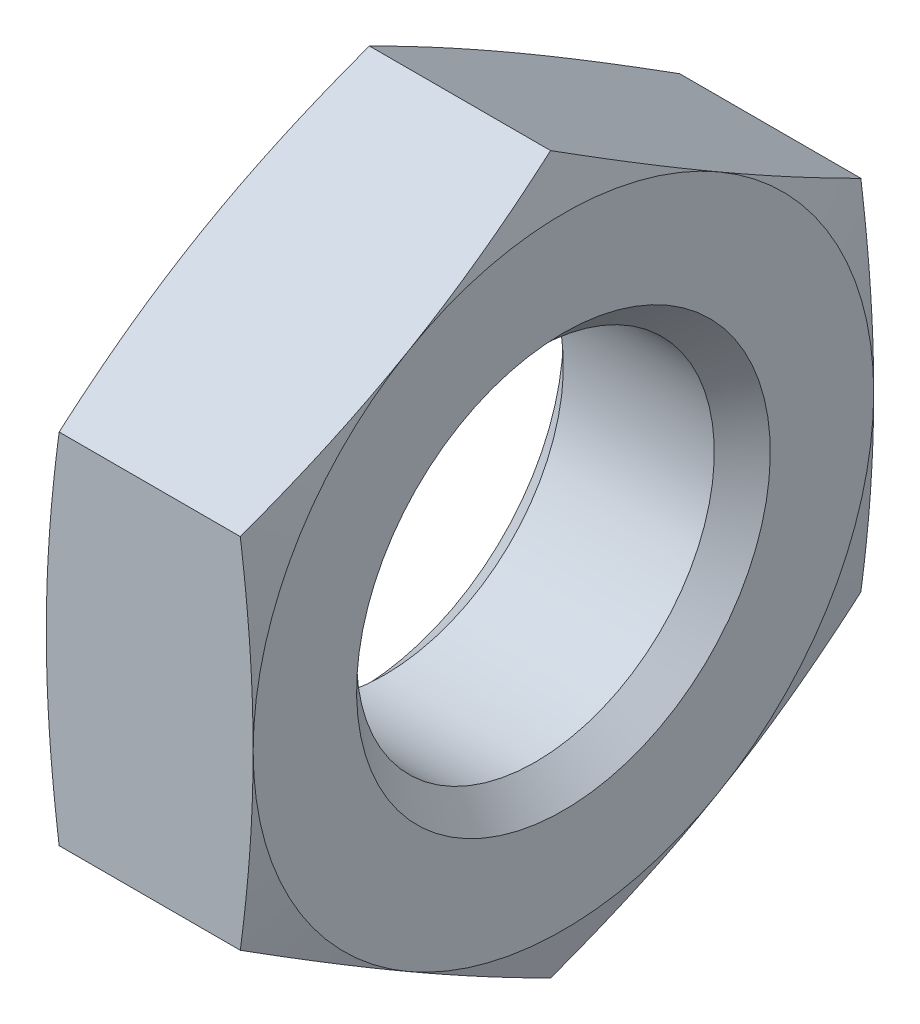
ISO-10303-21;
HEADER;
FILE_DESCRIPTION(('STEP AP214'),'2;1');
FILE_NAME('part.step','',(''),(''),'','','');
FILE_SCHEMA(('AUTOMOTIVE_DESIGN { 1 0 10303 214 1 1 1 1 }'));
ENDSEC;
DATA;
#1=APPLICATION_CONTEXT('core data for automotive mechanical design processes');
#2=APPLICATION_PROTOCOL_DEFINITION('international standard','automotive_design',2000,#1);
#3=PRODUCT_CONTEXT('',#1,'mechanical');
#4=PRODUCT('Part','Part','',(#3));
#5=PRODUCT_RELATED_PRODUCT_CATEGORY('part','',(#4));
#6=PRODUCT_DEFINITION_FORMATION('','',#4);
#7=PRODUCT_DEFINITION_CONTEXT('part definition',#1,'design');
#8=PRODUCT_DEFINITION('design','',#6,#7);
#9=PRODUCT_DEFINITION_SHAPE('','',#8);
#10=(LENGTH_UNIT() NAMED_UNIT(*) SI_UNIT(.MILLI.,.METRE.));
#11=(NAMED_UNIT(*) PLANE_ANGLE_UNIT() SI_UNIT($,.RADIAN.));
#12=(NAMED_UNIT(*) SI_UNIT($,.STERADIAN.) SOLID_ANGLE_UNIT());
#13=UNCERTAINTY_MEASURE_WITH_UNIT(LENGTH_MEASURE(1.E-05),#10,'distance_accuracy_value','');
#14=(GEOMETRIC_REPRESENTATION_CONTEXT(3) GLOBAL_UNCERTAINTY_ASSIGNED_CONTEXT((#13)) GLOBAL_UNIT_ASSIGNED_CONTEXT((#10,
#11,#12)) REPRESENTATION_CONTEXT('',''));
#15=CARTESIAN_POINT('',(0.,0.,0.));
#16=DIRECTION('',(0.,0.,1.));
#17=DIRECTION('',(1.,0.,0.));
#18=AXIS2_PLACEMENT_3D('',#15,#16,#17);
#19=DIRECTION('',(-0.707106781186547,0.707106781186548,0.));
#20=VECTOR('',#19,1.);
#21=CARTESIAN_POINT('',(0.54125,7.45875,0.));
#22=LINE('',#21,#20);
#23=CARTESIAN_POINT('',(8.,0.,0.));
#24=DIRECTION('',(-1.,0.,0.));
#25=AXIS1_PLACEMENT('',#23,#24);
#26=SURFACE_OF_REVOLUTION('',#22,#25);
#27=CARTESIAN_POINT('',(1.0825,0.,0.));
#28=DIRECTION('',(-1.,0.,0.));
#29=DIRECTION('',(0.,1.,0.));
#30=AXIS2_PLACEMENT_3D('',#27,#28,#29);
#31=CIRCLE('',#30,6.9175);
#32=CARTESIAN_POINT('',(1.0825,6.9175,0.));
#33=VERTEX_POINT('',#32);
#34=EDGE_CURVE('E400',#33,#33,#31,.T.);
#35=ORIENTED_EDGE('',*,*,#34,.F.);
#36=EDGE_LOOP('',(#35));
#37=FACE_BOUND('',#36,.T.);
#38=CARTESIAN_POINT('',(0.,0.,0.));
#39=DIRECTION('',(-1.,0.,0.));
#40=DIRECTION('',(0.,1.,0.));
#41=AXIS2_PLACEMENT_3D('',#38,#39,#40);
#42=CIRCLE('',#41,8.);
#43=CARTESIAN_POINT('',(0.,8.,0.));
#44=VERTEX_POINT('',#43);
#45=EDGE_CURVE('E11',#44,#44,#42,.T.);
#46=ORIENTED_EDGE('',*,*,#45,.T.);
#47=EDGE_LOOP('',(#46));
#48=FACE_BOUND('',#47,.T.);
#49=ADVANCED_FACE('F17',(#37,#48),#26,.F.);
#50=CARTESIAN_POINT('',(0.,10.,0.));
#51=DIRECTION('',(-1.,0.,0.));
#52=DIRECTION('',(0.,-1.,0.));
#53=AXIS2_PLACEMENT_3D('',#50,#51,#52);
#54=PLANE('',#53);
#55=CARTESIAN_POINT('',(0.,0.,0.));
#56=DIRECTION('',(-1.,0.,0.));
#57=DIRECTION('',(0.,1.,0.));
#58=AXIS2_PLACEMENT_3D('',#55,#56,#57);
#59=CIRCLE('',#58,12.);
#60=CARTESIAN_POINT('',(0.,10.3923048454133,6.));
#61=VERTEX_POINT('',#60);
#62=CARTESIAN_POINT('',(0.,10.3923048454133,-6.));
#63=VERTEX_POINT('',#62);
#64=EDGE_CURVE('E27',#61,#63,#59,.T.);
#65=ORIENTED_EDGE('',*,*,#64,.T.);
#66=CARTESIAN_POINT('',(0.,0.,0.));
#67=DIRECTION('',(-1.,0.,0.));
#68=DIRECTION('',(0.,1.,0.));
#69=AXIS2_PLACEMENT_3D('',#66,#67,#68);
#70=CIRCLE('',#69,12.);
#71=CARTESIAN_POINT('',(0.,0.,-12.));
#72=VERTEX_POINT('',#71);
#73=EDGE_CURVE('E312',#63,#72,#70,.T.);
#74=ORIENTED_EDGE('',*,*,#73,.T.);
#75=CARTESIAN_POINT('',(0.,0.,0.));
#76=DIRECTION('',(-1.,0.,0.));
#77=DIRECTION('',(0.,1.,0.));
#78=AXIS2_PLACEMENT_3D('',#75,#76,#77);
#79=CIRCLE('',#78,12.);
#80=CARTESIAN_POINT('',(0.,-10.3923048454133,-6.));
#81=VERTEX_POINT('',#80);
#82=EDGE_CURVE('E306',#72,#81,#79,.T.);
#83=ORIENTED_EDGE('',*,*,#82,.T.);
#84=CARTESIAN_POINT('',(0.,0.,0.));
#85=DIRECTION('',(-1.,0.,0.));
#86=DIRECTION('',(0.,1.,0.));
#87=AXIS2_PLACEMENT_3D('',#84,#85,#86);
#88=CIRCLE('',#87,12.);
#89=CARTESIAN_POINT('',(0.,-10.3923048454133,6.));
#90=VERTEX_POINT('',#89);
#91=EDGE_CURVE('E313',#81,#90,#88,.T.);
#92=ORIENTED_EDGE('',*,*,#91,.T.);
#93=CARTESIAN_POINT('',(0.,0.,0.));
#94=DIRECTION('',(-1.,0.,0.));
#95=DIRECTION('',(0.,1.,0.));
#96=AXIS2_PLACEMENT_3D('',#93,#94,#95);
#97=CIRCLE('',#96,12.);
#98=CARTESIAN_POINT('',(0.,0.,12.));
#99=VERTEX_POINT('',#98);
#100=EDGE_CURVE('E367',#90,#99,#97,.T.);
#101=ORIENTED_EDGE('',*,*,#100,.T.);
#102=CARTESIAN_POINT('',(0.,0.,0.));
#103=DIRECTION('',(-1.,0.,0.));
#104=DIRECTION('',(0.,1.,0.));
#105=AXIS2_PLACEMENT_3D('',#102,#103,#104);
#106=CIRCLE('',#105,12.);
#107=EDGE_CURVE('E340',#99,#61,#106,.T.);
#108=ORIENTED_EDGE('',*,*,#107,.T.);
#109=EDGE_LOOP('',(#65,#74,#83,#92,#101,#108));
#110=FACE_BOUND('',#109,.T.);
#111=ORIENTED_EDGE('',*,*,#45,.F.);
#112=EDGE_LOOP('',(#111));
#113=FACE_BOUND('',#112,.T.);
#114=ADVANCED_FACE('F153',(#110,#113),#54,.T.);
#115=CARTESIAN_POINT('',(8.,10.,0.));
#116=DIRECTION('',(1.,0.,0.));
#117=DIRECTION('',(0.,0.,-1.));
#118=AXIS2_PLACEMENT_3D('',#115,#116,#117);
#119=PLANE('',#118);
#120=CARTESIAN_POINT('',(8.,0.,0.));
#121=DIRECTION('',(-1.,0.,0.));
#122=DIRECTION('',(0.,1.,0.));
#123=AXIS2_PLACEMENT_3D('',#120,#121,#122);
#124=CIRCLE('',#123,8.);
#125=CARTESIAN_POINT('',(8.,8.,0.));
#126=VERTEX_POINT('',#125);
#127=EDGE_CURVE('E406',#126,#126,#124,.T.);
#128=ORIENTED_EDGE('',*,*,#127,.T.);
#129=EDGE_LOOP('',(#128));
#130=FACE_BOUND('',#129,.T.);
#131=CARTESIAN_POINT('',(8.,0.,0.));
#132=DIRECTION('',(-1.,0.,0.));
#133=DIRECTION('',(0.,1.,0.));
#134=AXIS2_PLACEMENT_3D('',#131,#132,#133);
#135=CIRCLE('',#134,12.);
#136=CARTESIAN_POINT('',(8.,10.3923048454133,6.));
#137=VERTEX_POINT('',#136);
#138=CARTESIAN_POINT('',(8.,10.3923048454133,-6.));
#139=VERTEX_POINT('',#138);
#140=EDGE_CURVE('E125',#137,#139,#135,.T.);
#141=ORIENTED_EDGE('',*,*,#140,.F.);
#142=CARTESIAN_POINT('',(8.,0.,0.));
#143=DIRECTION('',(-1.,0.,0.));
#144=DIRECTION('',(0.,1.,0.));
#145=AXIS2_PLACEMENT_3D('',#142,#143,#144);
#146=CIRCLE('',#145,12.);
#147=CARTESIAN_POINT('',(8.,0.,12.));
#148=VERTEX_POINT('',#147);
#149=EDGE_CURVE('E126',#148,#137,#146,.T.);
#150=ORIENTED_EDGE('',*,*,#149,.F.);
#151=CARTESIAN_POINT('',(8.,0.,0.));
#152=DIRECTION('',(-1.,0.,0.));
#153=DIRECTION('',(0.,1.,0.));
#154=AXIS2_PLACEMENT_3D('',#151,#152,#153);
#155=CIRCLE('',#154,12.);
#156=CARTESIAN_POINT('',(8.,-10.3923048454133,6.));
#157=VERTEX_POINT('',#156);
#158=EDGE_CURVE('E305',#157,#148,#155,.T.);
#159=ORIENTED_EDGE('',*,*,#158,.F.);
#160=CARTESIAN_POINT('',(8.,0.,0.));
#161=DIRECTION('',(-1.,0.,0.));
#162=DIRECTION('',(0.,1.,0.));
#163=AXIS2_PLACEMENT_3D('',#160,#161,#162);
#164=CIRCLE('',#163,12.);
#165=CARTESIAN_POINT('',(8.,-10.3923048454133,-6.));
#166=VERTEX_POINT('',#165);
#167=EDGE_CURVE('E353',#166,#157,#164,.T.);
#168=ORIENTED_EDGE('',*,*,#167,.F.);
#169=CARTESIAN_POINT('',(8.,0.,0.));
#170=DIRECTION('',(-1.,0.,0.));
#171=DIRECTION('',(0.,1.,0.));
#172=AXIS2_PLACEMENT_3D('',#169,#170,#171);
#173=CIRCLE('',#172,12.);
#174=CARTESIAN_POINT('',(8.,0.,-12.));
#175=VERTEX_POINT('',#174);
#176=EDGE_CURVE('E285',#175,#166,#173,.T.);
#177=ORIENTED_EDGE('',*,*,#176,.F.);
#178=CARTESIAN_POINT('',(8.,0.,0.));
#179=DIRECTION('',(-1.,0.,0.));
#180=DIRECTION('',(0.,1.,0.));
#181=AXIS2_PLACEMENT_3D('',#178,#179,#180);
#182=CIRCLE('',#181,12.);
#183=EDGE_CURVE('E293',#139,#175,#182,.T.);
#184=ORIENTED_EDGE('',*,*,#183,.F.);
#185=EDGE_LOOP('',(#141,#150,#159,#168,#177,#184));
#186=FACE_BOUND('',#185,.T.);
#187=ADVANCED_FACE('F157',(#130,#186),#119,.T.);
#188=DIRECTION('',(0.707106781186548,0.707106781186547,0.));
#189=VECTOR('',#188,1.);
#190=CARTESIAN_POINT('',(7.45875,7.45875,0.));
#191=LINE('',#190,#189);
#192=CARTESIAN_POINT('',(0.,0.,0.));
#193=DIRECTION('',(1.,0.,0.));
#194=AXIS1_PLACEMENT('',#192,#193);
#195=SURFACE_OF_REVOLUTION('',#191,#194);
#196=ORIENTED_EDGE('',*,*,#127,.F.);
#197=EDGE_LOOP('',(#196));
#198=FACE_BOUND('',#197,.T.);
#199=CARTESIAN_POINT('',(6.9175,0.,0.));
#200=DIRECTION('',(-1.,0.,0.));
#201=DIRECTION('',(0.,1.,0.));
#202=AXIS2_PLACEMENT_3D('',#199,#200,#201);
#203=CIRCLE('',#202,6.9175);
#204=CARTESIAN_POINT('',(6.9175,6.9175,0.));
#205=VERTEX_POINT('',#204);
#206=EDGE_CURVE('E323',#205,#205,#203,.T.);
#207=ORIENTED_EDGE('',*,*,#206,.T.);
#208=EDGE_LOOP('',(#207));
#209=FACE_BOUND('',#208,.T.);
#210=ADVANCED_FACE('F161',(#198,#209),#195,.F.);
#211=CARTESIAN_POINT('',(4.,0.,0.));
#212=DIRECTION('',(1.,0.,0.));
#213=DIRECTION('',(0.,1.,0.));
#214=AXIS2_PLACEMENT_3D('',#211,#212,#213);
#215=CIRCLE('',#214,6.9175);
#216=DIRECTION('',(-1.,0.,0.));
#217=VECTOR('',#216,1.);
#218=SURFACE_OF_LINEAR_EXTRUSION('',#215,#217);
#219=ORIENTED_EDGE('',*,*,#206,.F.);
#220=EDGE_LOOP('',(#219));
#221=FACE_BOUND('',#220,.T.);
#222=ORIENTED_EDGE('',*,*,#34,.T.);
#223=EDGE_LOOP('',(#222));
#224=FACE_BOUND('',#223,.T.);
#225=ADVANCED_FACE('F165',(#221,#224),#218,.T.);
#226=DIRECTION('',(0.258819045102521,-0.965925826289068,0.));
#227=VECTOR('',#226,1.);
#228=CARTESIAN_POINT('',(6.,19.4641016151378,0.));
#229=LINE('',#228,#227);
#230=CARTESIAN_POINT('',(11.2153903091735,0.,0.));
#231=DIRECTION('',(-1.,0.,0.));
#232=AXIS1_PLACEMENT('',#230,#231);
#233=SURFACE_OF_REVOLUTION('',#229,#232);
#234=CARTESIAN_POINT('',(8.,10.3923048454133,6.));
#235=CARTESIAN_POINT('',(8.,8.78460969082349,8.78460969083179));
#236=CARTESIAN_POINT('',(7.50257738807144,6.92820323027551,12.));
#237=(BOUNDED_CURVE() B_SPLINE_CURVE(2,(#234,#235,#236),.UNSPECIFIED.,.F.,
.F.) B_SPLINE_CURVE_WITH_KNOTS((3,3),(24.476174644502,33.6439861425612),
.UNSPECIFIED.) CURVE() GEOMETRIC_REPRESENTATION_ITEM() RATIONAL_B_SPLINE_CURVE((1.,
1.10247265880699,1.12818086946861)) REPRESENTATION_ITEM(''));
#238=CARTESIAN_POINT('',(7.50257738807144,6.92820323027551,12.));
#239=VERTEX_POINT('',#238);
#240=EDGE_CURVE('E131',#137,#239,#237,.T.);
#241=ORIENTED_EDGE('',*,*,#240,.T.);
#242=CARTESIAN_POINT('',(7.50257738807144,6.92820323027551,12.));
#243=CARTESIAN_POINT('',(8.,3.21539030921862,12.));
#244=CARTESIAN_POINT('',(8.,0.,12.));
#245=(BOUNDED_CURVE() B_SPLINE_CURVE(2,(#242,#243,#244),.UNSPECIFIED.,.F.,
.F.) B_SPLINE_CURVE_WITH_KNOTS((3,3),(15.3083631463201,24.476174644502),
.UNSPECIFIED.) CURVE() GEOMETRIC_REPRESENTATION_ITEM() RATIONAL_B_SPLINE_CURVE((1.12818086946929,
1.10247265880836,1.)) REPRESENTATION_ITEM(''));
#246=EDGE_CURVE('E392',#239,#148,#245,.T.);
#247=ORIENTED_EDGE('',*,*,#246,.T.);
#248=ORIENTED_EDGE('',*,*,#149,.T.);
#249=EDGE_LOOP('',(#241,#247,#248));
#250=FACE_BOUND('',#249,.T.);
#251=ADVANCED_FACE('F169',(#250),#233,.F.);
#252=DIRECTION('',(0.258819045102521,-0.965925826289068,0.));
#253=VECTOR('',#252,1.);
#254=CARTESIAN_POINT('',(6.,19.4641016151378,0.));
#255=LINE('',#254,#253);
#256=CARTESIAN_POINT('',(11.2153903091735,0.,0.));
#257=DIRECTION('',(-1.,0.,0.));
#258=AXIS1_PLACEMENT('',#256,#257);
#259=SURFACE_OF_REVOLUTION('',#255,#258);
#260=CARTESIAN_POINT('',(8.,10.3923048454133,-6.));
#261=CARTESIAN_POINT('',(8.,12.000000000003,-3.21539030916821));
#262=CARTESIAN_POINT('',(7.50257738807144,13.856406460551,0.));
#263=(BOUNDED_CURVE() B_SPLINE_CURVE(2,(#260,#261,#262),.UNSPECIFIED.,.F.,
.F.) B_SPLINE_CURVE_WITH_KNOTS((3,3),(24.476174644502,33.6439861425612),
.UNSPECIFIED.) CURVE() GEOMETRIC_REPRESENTATION_ITEM() RATIONAL_B_SPLINE_CURVE((1.,
1.10247265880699,1.12818086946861)) REPRESENTATION_ITEM(''));
#264=CARTESIAN_POINT('',(7.50257738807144,13.856406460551,0.));
#265=VERTEX_POINT('',#264);
#266=EDGE_CURVE('E115',#139,#265,#263,.T.);
#267=ORIENTED_EDGE('',*,*,#266,.T.);
#268=CARTESIAN_POINT('',(7.50257738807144,13.856406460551,0.));
#269=CARTESIAN_POINT('',(8.,12.0000000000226,3.21539030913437));
#270=CARTESIAN_POINT('',(8.,10.3923048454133,6.));
#271=(BOUNDED_CURVE() B_SPLINE_CURVE(2,(#268,#269,#270),.UNSPECIFIED.,.F.,
.F.) B_SPLINE_CURVE_WITH_KNOTS((3,3),(15.3083631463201,24.476174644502),
.UNSPECIFIED.) CURVE() GEOMETRIC_REPRESENTATION_ITEM() RATIONAL_B_SPLINE_CURVE((1.1281808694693,
1.10247265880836,1.)) REPRESENTATION_ITEM(''));
#272=EDGE_CURVE('E124',#265,#137,#271,.T.);
#273=ORIENTED_EDGE('',*,*,#272,.T.);
#274=ORIENTED_EDGE('',*,*,#140,.T.);
#275=EDGE_LOOP('',(#267,#273,#274));
#276=FACE_BOUND('',#275,.T.);
#277=ADVANCED_FACE('F123',(#276),#259,.F.);
#278=DIRECTION('',(0.258819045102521,-0.965925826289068,0.));
#279=VECTOR('',#278,1.);
#280=CARTESIAN_POINT('',(6.,19.4641016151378,0.));
#281=LINE('',#280,#279);
#282=CARTESIAN_POINT('',(11.2153903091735,0.,0.));
#283=DIRECTION('',(-1.,0.,0.));
#284=AXIS1_PLACEMENT('',#282,#283);
#285=SURFACE_OF_REVOLUTION('',#281,#284);
#286=CARTESIAN_POINT('',(8.,0.,-12.));
#287=CARTESIAN_POINT('',(8.,3.21539030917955,-12.));
#288=CARTESIAN_POINT('',(7.50257738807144,6.92820323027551,-12.));
#289=(BOUNDED_CURVE() B_SPLINE_CURVE(2,(#286,#287,#288),.UNSPECIFIED.,.F.,
.F.) B_SPLINE_CURVE_WITH_KNOTS((3,3),(24.476174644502,33.6439861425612),
.UNSPECIFIED.) CURVE() GEOMETRIC_REPRESENTATION_ITEM() RATIONAL_B_SPLINE_CURVE((1.,
1.10247265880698,1.1281808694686)) REPRESENTATION_ITEM(''));
#290=CARTESIAN_POINT('',(7.50257738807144,6.92820323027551,-12.));
#291=VERTEX_POINT('',#290);
#292=EDGE_CURVE('E133',#175,#291,#289,.T.);
#293=ORIENTED_EDGE('',*,*,#292,.T.);
#294=CARTESIAN_POINT('',(7.50257738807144,6.92820323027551,-12.));
#295=CARTESIAN_POINT('',(8.,8.78460969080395,-8.78460969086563));
#296=CARTESIAN_POINT('',(8.,10.3923048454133,-6.));
#297=(BOUNDED_CURVE() B_SPLINE_CURVE(2,(#294,#295,#296),.UNSPECIFIED.,.F.,
.F.) B_SPLINE_CURVE_WITH_KNOTS((3,3),(15.3083631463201,24.476174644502),
.UNSPECIFIED.) CURVE() GEOMETRIC_REPRESENTATION_ITEM() RATIONAL_B_SPLINE_CURVE((1.1281808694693,
1.10247265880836,1.)) REPRESENTATION_ITEM(''));
#298=EDGE_CURVE('E318',#291,#139,#297,.T.);
#299=ORIENTED_EDGE('',*,*,#298,.T.);
#300=ORIENTED_EDGE('',*,*,#183,.T.);
#301=EDGE_LOOP('',(#293,#299,#300));
#302=FACE_BOUND('',#301,.T.);
#303=ADVANCED_FACE('F182',(#302),#285,.F.);
#304=DIRECTION('',(0.258819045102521,-0.965925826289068,0.));
#305=VECTOR('',#304,1.);
#306=CARTESIAN_POINT('',(6.,19.4641016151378,0.));
#307=LINE('',#306,#305);
#308=CARTESIAN_POINT('',(11.2153903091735,0.,0.));
#309=DIRECTION('',(-1.,0.,0.));
#310=AXIS1_PLACEMENT('',#308,#309);
#311=SURFACE_OF_REVOLUTION('',#307,#310);
#312=CARTESIAN_POINT('',(7.50257738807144,-6.92820323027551,-12.));
#313=CARTESIAN_POINT('',(8.,-3.21539030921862,-12.));
#314=CARTESIAN_POINT('',(8.,0.,-12.));
#315=(BOUNDED_CURVE() B_SPLINE_CURVE(2,(#312,#313,#314),.UNSPECIFIED.,.F.,
.F.) B_SPLINE_CURVE_WITH_KNOTS((3,3),(15.3083631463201,24.476174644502),
.UNSPECIFIED.) CURVE() GEOMETRIC_REPRESENTATION_ITEM() RATIONAL_B_SPLINE_CURVE((1.12818086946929,
1.10247265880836,1.)) REPRESENTATION_ITEM(''));
#316=CARTESIAN_POINT('',(7.50257738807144,-6.92820323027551,-12.));
#317=VERTEX_POINT('',#316);
#318=EDGE_CURVE('E286',#317,#175,#315,.T.);
#319=ORIENTED_EDGE('',*,*,#318,.T.);
#320=ORIENTED_EDGE('',*,*,#176,.T.);
#321=CARTESIAN_POINT('',(8.,-10.3923048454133,-6.));
#322=CARTESIAN_POINT('',(8.,-8.78460969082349,-8.78460969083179));
#323=CARTESIAN_POINT('',(7.50257738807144,-6.92820323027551,-12.));
#324=(BOUNDED_CURVE() B_SPLINE_CURVE(2,(#321,#322,#323),.UNSPECIFIED.,.F.,
.F.) B_SPLINE_CURVE_WITH_KNOTS((3,3),(24.476174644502,33.6439861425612),
.UNSPECIFIED.) CURVE() GEOMETRIC_REPRESENTATION_ITEM() RATIONAL_B_SPLINE_CURVE((1.,
1.10247265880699,1.12818086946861)) REPRESENTATION_ITEM(''));
#325=EDGE_CURVE('E281',#166,#317,#324,.T.);
#326=ORIENTED_EDGE('',*,*,#325,.T.);
#327=EDGE_LOOP('',(#319,#320,#326));
#328=FACE_BOUND('',#327,.T.);
#329=ADVANCED_FACE('F185',(#328),#311,.F.);
#330=DIRECTION('',(0.258819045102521,-0.965925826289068,0.));
#331=VECTOR('',#330,1.);
#332=CARTESIAN_POINT('',(6.,19.4641016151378,0.));
#333=LINE('',#332,#331);
#334=CARTESIAN_POINT('',(11.2153903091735,0.,0.));
#335=DIRECTION('',(-1.,0.,0.));
#336=AXIS1_PLACEMENT('',#334,#335);
#337=SURFACE_OF_REVOLUTION('',#333,#336);
#338=CARTESIAN_POINT('',(7.50257738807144,-13.856406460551,0.));
#339=CARTESIAN_POINT('',(8.,-12.0000000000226,-3.21539030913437));
#340=CARTESIAN_POINT('',(8.,-10.3923048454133,-6.));
#341=(BOUNDED_CURVE() B_SPLINE_CURVE(2,(#338,#339,#340),.UNSPECIFIED.,.F.,
.F.) B_SPLINE_CURVE_WITH_KNOTS((3,3),(15.30836314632,24.476174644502),
.UNSPECIFIED.) CURVE() GEOMETRIC_REPRESENTATION_ITEM() RATIONAL_B_SPLINE_CURVE((1.1281808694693,
1.10247265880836,1.)) REPRESENTATION_ITEM(''));
#342=CARTESIAN_POINT('',(7.50257738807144,-13.856406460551,0.));
#343=VERTEX_POINT('',#342);
#344=EDGE_CURVE('E269',#343,#166,#341,.T.);
#345=ORIENTED_EDGE('',*,*,#344,.T.);
#346=ORIENTED_EDGE('',*,*,#167,.T.);
#347=CARTESIAN_POINT('',(8.,-10.3923048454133,6.));
#348=CARTESIAN_POINT('',(8.,-12.000000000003,3.2153903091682));
#349=CARTESIAN_POINT('',(7.50257738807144,-13.856406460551,0.));
#350=(BOUNDED_CURVE() B_SPLINE_CURVE(2,(#347,#348,#349),.UNSPECIFIED.,.F.,
.F.) B_SPLINE_CURVE_WITH_KNOTS((3,3),(24.476174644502,33.6439861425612),
.UNSPECIFIED.) CURVE() GEOMETRIC_REPRESENTATION_ITEM() RATIONAL_B_SPLINE_CURVE((1.,
1.10247265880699,1.12818086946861)) REPRESENTATION_ITEM(''));
#351=EDGE_CURVE('E304',#157,#343,#350,.T.);
#352=ORIENTED_EDGE('',*,*,#351,.T.);
#353=EDGE_LOOP('',(#345,#346,#352));
#354=FACE_BOUND('',#353,.T.);
#355=ADVANCED_FACE('F189',(#354),#337,.F.);
#356=DIRECTION('',(0.258819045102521,-0.965925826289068,0.));
#357=VECTOR('',#356,1.);
#358=CARTESIAN_POINT('',(6.,19.4641016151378,0.));
#359=LINE('',#358,#357);
#360=CARTESIAN_POINT('',(11.2153903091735,0.,0.));
#361=DIRECTION('',(-1.,0.,0.));
#362=AXIS1_PLACEMENT('',#360,#361);
#363=SURFACE_OF_REVOLUTION('',#359,#362);
#364=CARTESIAN_POINT('',(7.50257738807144,-6.92820323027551,12.));
#365=CARTESIAN_POINT('',(8.,-8.78460969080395,8.78460969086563));
#366=CARTESIAN_POINT('',(8.,-10.3923048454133,6.));
#367=(BOUNDED_CURVE() B_SPLINE_CURVE(2,(#364,#365,#366),.UNSPECIFIED.,.F.,
.F.) B_SPLINE_CURVE_WITH_KNOTS((3,3),(15.30836314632,24.476174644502),
.UNSPECIFIED.) CURVE() GEOMETRIC_REPRESENTATION_ITEM() RATIONAL_B_SPLINE_CURVE((1.1281808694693,
1.10247265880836,1.)) REPRESENTATION_ITEM(''));
#368=CARTESIAN_POINT('',(7.50257738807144,-6.92820323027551,12.));
#369=VERTEX_POINT('',#368);
#370=EDGE_CURVE('E299',#369,#157,#367,.T.);
#371=ORIENTED_EDGE('',*,*,#370,.T.);
#372=ORIENTED_EDGE('',*,*,#158,.T.);
#373=CARTESIAN_POINT('',(8.,0.,12.));
#374=CARTESIAN_POINT('',(8.,-3.21539030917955,12.));
#375=CARTESIAN_POINT('',(7.50257738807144,-6.92820323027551,12.));
#376=(BOUNDED_CURVE() B_SPLINE_CURVE(2,(#373,#374,#375),.UNSPECIFIED.,.F.,
.F.) B_SPLINE_CURVE_WITH_KNOTS((3,3),(24.476174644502,33.6439861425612),
.UNSPECIFIED.) CURVE() GEOMETRIC_REPRESENTATION_ITEM() RATIONAL_B_SPLINE_CURVE((1.,
1.10247265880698,1.12818086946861)) REPRESENTATION_ITEM(''));
#377=EDGE_CURVE('E361',#148,#369,#376,.T.);
#378=ORIENTED_EDGE('',*,*,#377,.T.);
#379=EDGE_LOOP('',(#371,#372,#378));
#380=FACE_BOUND('',#379,.T.);
#381=ADVANCED_FACE('F200',(#380),#363,.F.);
#382=DIRECTION('',(-0.258819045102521,-0.965925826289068,0.));
#383=VECTOR('',#382,1.);
#384=CARTESIAN_POINT('',(2.,19.4641016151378,0.));
#385=LINE('',#384,#383);
#386=CARTESIAN_POINT('',(-3.21539030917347,0.,0.));
#387=DIRECTION('',(1.,0.,0.));
#388=AXIS1_PLACEMENT('',#386,#387);
#389=SURFACE_OF_REVOLUTION('',#385,#388);
#390=CARTESIAN_POINT('',(0.,10.3923048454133,6.));
#391=CARTESIAN_POINT('',(0.,12.000000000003,3.21539030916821));
#392=CARTESIAN_POINT('',(0.497422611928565,13.856406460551,0.));
#393=(BOUNDED_CURVE() B_SPLINE_CURVE(2,(#390,#391,#392),.UNSPECIFIED.,.F.,
.F.) B_SPLINE_CURVE_WITH_KNOTS((3,3),(24.476174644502,33.6439861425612),
.UNSPECIFIED.) CURVE() GEOMETRIC_REPRESENTATION_ITEM() RATIONAL_B_SPLINE_CURVE((1.,
1.10247265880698,1.12818086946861)) REPRESENTATION_ITEM(''));
#394=CARTESIAN_POINT('',(0.497422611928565,13.856406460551,0.));
#395=VERTEX_POINT('',#394);
#396=EDGE_CURVE('E354',#61,#395,#393,.T.);
#397=ORIENTED_EDGE('',*,*,#396,.T.);
#398=CARTESIAN_POINT('',(0.497422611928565,13.856406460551,0.));
#399=CARTESIAN_POINT('',(0.,12.0000000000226,-3.21539030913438));
#400=CARTESIAN_POINT('',(0.,10.3923048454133,-6.));
#401=(BOUNDED_CURVE() B_SPLINE_CURVE(2,(#398,#399,#400),.UNSPECIFIED.,.F.,
.F.) B_SPLINE_CURVE_WITH_KNOTS((3,3),(15.3083631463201,24.476174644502),
.UNSPECIFIED.) CURVE() GEOMETRIC_REPRESENTATION_ITEM() RATIONAL_B_SPLINE_CURVE((1.1281808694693,
1.10247265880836,1.)) REPRESENTATION_ITEM(''));
#402=EDGE_CURVE('E36',#395,#63,#401,.T.);
#403=ORIENTED_EDGE('',*,*,#402,.T.);
#404=ORIENTED_EDGE('',*,*,#64,.F.);
#405=EDGE_LOOP('',(#397,#403,#404));
#406=FACE_BOUND('',#405,.T.);
#407=ADVANCED_FACE('F203',(#406),#389,.F.);
#408=DIRECTION('',(-0.258819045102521,-0.965925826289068,0.));
#409=VECTOR('',#408,1.);
#410=CARTESIAN_POINT('',(2.,19.4641016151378,0.));
#411=LINE('',#410,#409);
#412=CARTESIAN_POINT('',(-3.21539030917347,0.,0.));
#413=DIRECTION('',(1.,0.,0.));
#414=AXIS1_PLACEMENT('',#412,#413);
#415=SURFACE_OF_REVOLUTION('',#411,#414);
#416=CARTESIAN_POINT('',(0.,0.,12.));
#417=CARTESIAN_POINT('',(0.,3.21539030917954,12.));
#418=CARTESIAN_POINT('',(0.497422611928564,6.92820323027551,12.));
#419=(BOUNDED_CURVE() B_SPLINE_CURVE(2,(#416,#417,#418),.UNSPECIFIED.,.F.,
.F.) B_SPLINE_CURVE_WITH_KNOTS((3,3),(24.476174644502,33.6439861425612),
.UNSPECIFIED.) CURVE() GEOMETRIC_REPRESENTATION_ITEM() RATIONAL_B_SPLINE_CURVE((1.,
1.10247265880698,1.12818086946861)) REPRESENTATION_ITEM(''));
#420=CARTESIAN_POINT('',(0.497422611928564,6.92820323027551,12.));
#421=VERTEX_POINT('',#420);
#422=EDGE_CURVE('E388',#99,#421,#419,.T.);
#423=ORIENTED_EDGE('',*,*,#422,.T.);
#424=CARTESIAN_POINT('',(0.497422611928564,6.92820323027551,12.));
#425=CARTESIAN_POINT('',(0.,8.78460969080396,8.78460969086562));
#426=CARTESIAN_POINT('',(0.,10.3923048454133,6.));
#427=(BOUNDED_CURVE() B_SPLINE_CURVE(2,(#424,#425,#426),.UNSPECIFIED.,.F.,
.F.) B_SPLINE_CURVE_WITH_KNOTS((3,3),(15.3083631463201,24.476174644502),
.UNSPECIFIED.) CURVE() GEOMETRIC_REPRESENTATION_ITEM() RATIONAL_B_SPLINE_CURVE((1.1281808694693,
1.10247265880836,1.)) REPRESENTATION_ITEM(''));
#428=EDGE_CURVE('E82',#421,#61,#427,.T.);
#429=ORIENTED_EDGE('',*,*,#428,.T.);
#430=ORIENTED_EDGE('',*,*,#107,.F.);
#431=EDGE_LOOP('',(#423,#429,#430));
#432=FACE_BOUND('',#431,.T.);
#433=ADVANCED_FACE('F207',(#432),#415,.F.);
#434=DIRECTION('',(-0.258819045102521,-0.965925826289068,0.));
#435=VECTOR('',#434,1.);
#436=CARTESIAN_POINT('',(2.,19.4641016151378,0.));
#437=LINE('',#436,#435);
#438=CARTESIAN_POINT('',(-3.21539030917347,0.,0.));
#439=DIRECTION('',(1.,0.,0.));
#440=AXIS1_PLACEMENT('',#438,#439);
#441=SURFACE_OF_REVOLUTION('',#437,#440);
#442=CARTESIAN_POINT('',(0.,-10.3923048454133,6.));
#443=CARTESIAN_POINT('',(0.,-8.78460969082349,8.78460969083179));
#444=CARTESIAN_POINT('',(0.497422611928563,-6.92820323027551,12.));
#445=(BOUNDED_CURVE() B_SPLINE_CURVE(2,(#442,#443,#444),.UNSPECIFIED.,.F.,
.F.) B_SPLINE_CURVE_WITH_KNOTS((3,3),(24.476174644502,33.6439861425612),
.UNSPECIFIED.) CURVE() GEOMETRIC_REPRESENTATION_ITEM() RATIONAL_B_SPLINE_CURVE((1.,
1.10247265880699,1.12818086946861)) REPRESENTATION_ITEM(''));
#446=CARTESIAN_POINT('',(0.497422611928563,-6.92820323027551,12.));
#447=VERTEX_POINT('',#446);
#448=EDGE_CURVE('E259',#90,#447,#445,.T.);
#449=ORIENTED_EDGE('',*,*,#448,.T.);
#450=CARTESIAN_POINT('',(0.497422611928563,-6.92820323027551,12.));
#451=CARTESIAN_POINT('',(0.,-3.21539030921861,12.));
#452=CARTESIAN_POINT('',(0.,0.,12.));
#453=(BOUNDED_CURVE() B_SPLINE_CURVE(2,(#450,#451,#452),.UNSPECIFIED.,.F.,
.F.) B_SPLINE_CURVE_WITH_KNOTS((3,3),(15.30836314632,24.476174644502),
.UNSPECIFIED.) CURVE() GEOMETRIC_REPRESENTATION_ITEM() RATIONAL_B_SPLINE_CURVE((1.1281808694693,
1.10247265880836,1.)) REPRESENTATION_ITEM(''));
#454=EDGE_CURVE('E92',#447,#99,#453,.T.);
#455=ORIENTED_EDGE('',*,*,#454,.T.);
#456=ORIENTED_EDGE('',*,*,#100,.F.);
#457=EDGE_LOOP('',(#449,#455,#456));
#458=FACE_BOUND('',#457,.T.);
#459=ADVANCED_FACE('F210',(#458),#441,.F.);
#460=DIRECTION('',(-0.258819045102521,-0.965925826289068,0.));
#461=VECTOR('',#460,1.);
#462=CARTESIAN_POINT('',(2.,19.4641016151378,0.));
#463=LINE('',#462,#461);
#464=CARTESIAN_POINT('',(-3.21539030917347,0.,0.));
#465=DIRECTION('',(1.,0.,0.));
#466=AXIS1_PLACEMENT('',#464,#465);
#467=SURFACE_OF_REVOLUTION('',#463,#466);
#468=CARTESIAN_POINT('',(0.497422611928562,-13.856406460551,0.));
#469=CARTESIAN_POINT('',(0.,-12.0000000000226,3.21539030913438));
#470=CARTESIAN_POINT('',(0.,-10.3923048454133,6.));
#471=(BOUNDED_CURVE() B_SPLINE_CURVE(2,(#468,#469,#470),.UNSPECIFIED.,.F.,
.F.) B_SPLINE_CURVE_WITH_KNOTS((3,3),(15.3083631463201,24.476174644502),
.UNSPECIFIED.) CURVE() GEOMETRIC_REPRESENTATION_ITEM() RATIONAL_B_SPLINE_CURVE((1.1281808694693,
1.10247265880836,1.)) REPRESENTATION_ITEM(''));
#472=CARTESIAN_POINT('',(0.497422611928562,-13.856406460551,0.));
#473=VERTEX_POINT('',#472);
#474=EDGE_CURVE('E254',#473,#90,#471,.T.);
#475=ORIENTED_EDGE('',*,*,#474,.T.);
#476=ORIENTED_EDGE('',*,*,#91,.F.);
#477=CARTESIAN_POINT('',(0.,-10.3923048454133,-6.));
#478=CARTESIAN_POINT('',(0.,-12.000000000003,-3.21539030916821));
#479=CARTESIAN_POINT('',(0.497422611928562,-13.856406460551,0.));
#480=(BOUNDED_CURVE() B_SPLINE_CURVE(2,(#477,#478,#479),.UNSPECIFIED.,.F.,
.F.) B_SPLINE_CURVE_WITH_KNOTS((3,3),(24.476174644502,33.6439861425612),
.UNSPECIFIED.) CURVE() GEOMETRIC_REPRESENTATION_ITEM() RATIONAL_B_SPLINE_CURVE((1.,
1.10247265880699,1.12818086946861)) REPRESENTATION_ITEM(''));
#481=EDGE_CURVE('E262',#81,#473,#480,.T.);
#482=ORIENTED_EDGE('',*,*,#481,.T.);
#483=EDGE_LOOP('',(#475,#476,#482));
#484=FACE_BOUND('',#483,.T.);
#485=ADVANCED_FACE('F219',(#484),#467,.F.);
#486=DIRECTION('',(-0.258819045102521,-0.965925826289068,0.));
#487=VECTOR('',#486,1.);
#488=CARTESIAN_POINT('',(2.,19.4641016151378,0.));
#489=LINE('',#488,#487);
#490=CARTESIAN_POINT('',(-3.21539030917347,0.,0.));
#491=DIRECTION('',(1.,0.,0.));
#492=AXIS1_PLACEMENT('',#490,#491);
#493=SURFACE_OF_REVOLUTION('',#489,#492);
#494=CARTESIAN_POINT('',(0.497422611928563,-6.92820323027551,-12.));
#495=CARTESIAN_POINT('',(0.,-8.78460969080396,-8.78460969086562));
#496=CARTESIAN_POINT('',(0.,-10.3923048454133,-6.));
#497=(BOUNDED_CURVE() B_SPLINE_CURVE(2,(#494,#495,#496),.UNSPECIFIED.,.F.,
.F.) B_SPLINE_CURVE_WITH_KNOTS((3,3),(15.3083631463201,24.476174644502),
.UNSPECIFIED.) CURVE() GEOMETRIC_REPRESENTATION_ITEM() RATIONAL_B_SPLINE_CURVE((1.1281808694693,
1.10247265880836,1.)) REPRESENTATION_ITEM(''));
#498=CARTESIAN_POINT('',(0.497422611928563,-6.92820323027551,-12.));
#499=VERTEX_POINT('',#498);
#500=EDGE_CURVE('E371',#499,#81,#497,.T.);
#501=ORIENTED_EDGE('',*,*,#500,.T.);
#502=ORIENTED_EDGE('',*,*,#82,.F.);
#503=CARTESIAN_POINT('',(0.,0.,-12.));
#504=CARTESIAN_POINT('',(0.,-3.21539030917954,-12.));
#505=CARTESIAN_POINT('',(0.497422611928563,-6.92820323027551,-12.));
#506=(BOUNDED_CURVE() B_SPLINE_CURVE(2,(#503,#504,#505),.UNSPECIFIED.,.F.,
.F.) B_SPLINE_CURVE_WITH_KNOTS((3,3),(24.476174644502,33.6439861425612),
.UNSPECIFIED.) CURVE() GEOMETRIC_REPRESENTATION_ITEM() RATIONAL_B_SPLINE_CURVE((1.,
1.10247265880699,1.12818086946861)) REPRESENTATION_ITEM(''));
#507=EDGE_CURVE('E330',#72,#499,#506,.T.);
#508=ORIENTED_EDGE('',*,*,#507,.T.);
#509=EDGE_LOOP('',(#501,#502,#508));
#510=FACE_BOUND('',#509,.T.);
#511=ADVANCED_FACE('F222',(#510),#493,.F.);
#512=DIRECTION('',(-0.258819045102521,-0.965925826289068,0.));
#513=VECTOR('',#512,1.);
#514=CARTESIAN_POINT('',(2.,19.4641016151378,0.));
#515=LINE('',#514,#513);
#516=CARTESIAN_POINT('',(-3.21539030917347,0.,0.));
#517=DIRECTION('',(1.,0.,0.));
#518=AXIS1_PLACEMENT('',#516,#517);
#519=SURFACE_OF_REVOLUTION('',#515,#518);
#520=CARTESIAN_POINT('',(0.497422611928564,6.92820323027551,-12.));
#521=CARTESIAN_POINT('',(0.,3.21539030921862,-12.));
#522=CARTESIAN_POINT('',(0.,0.,-12.));
#523=(BOUNDED_CURVE() B_SPLINE_CURVE(2,(#520,#521,#522),.UNSPECIFIED.,.F.,
.F.) B_SPLINE_CURVE_WITH_KNOTS((3,3),(15.3083631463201,24.476174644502),
.UNSPECIFIED.) CURVE() GEOMETRIC_REPRESENTATION_ITEM() RATIONAL_B_SPLINE_CURVE((1.12818086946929,
1.10247265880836,1.)) REPRESENTATION_ITEM(''));
#524=CARTESIAN_POINT('',(0.497422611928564,6.92820323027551,-12.));
#525=VERTEX_POINT('',#524);
#526=EDGE_CURVE('E273',#525,#72,#523,.T.);
#527=ORIENTED_EDGE('',*,*,#526,.T.);
#528=ORIENTED_EDGE('',*,*,#73,.F.);
#529=CARTESIAN_POINT('',(0.,10.3923048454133,-6.));
#530=CARTESIAN_POINT('',(0.,8.78460969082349,-8.78460969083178));
#531=CARTESIAN_POINT('',(0.497422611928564,6.92820323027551,-12.));
#532=(BOUNDED_CURVE() B_SPLINE_CURVE(2,(#529,#530,#531),.UNSPECIFIED.,.F.,
.F.) B_SPLINE_CURVE_WITH_KNOTS((3,3),(24.476174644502,33.6439861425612),
.UNSPECIFIED.) CURVE() GEOMETRIC_REPRESENTATION_ITEM() RATIONAL_B_SPLINE_CURVE((1.,
1.10247265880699,1.12818086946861)) REPRESENTATION_ITEM(''));
#533=EDGE_CURVE('E139',#63,#525,#532,.T.);
#534=ORIENTED_EDGE('',*,*,#533,.T.);
#535=EDGE_LOOP('',(#527,#528,#534));
#536=FACE_BOUND('',#535,.T.);
#537=ADVANCED_FACE('F226',(#536),#519,.F.);
#538=CARTESIAN_POINT('',(9.,-6.92820323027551,-12.));
#539=DIRECTION('',(0.,-0.866025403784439,-0.5));
#540=DIRECTION('',(0.,0.5,-0.866025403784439));
#541=AXIS2_PLACEMENT_3D('',#538,#539,#540);
#542=PLANE('',#541);
#543=ORIENTED_EDGE('',*,*,#481,.F.);
#544=ORIENTED_EDGE('',*,*,#500,.F.);
#545=DIRECTION('',(-1.,0.,0.));
#546=VECTOR('',#545,1.);
#547=CARTESIAN_POINT('',(9.,-6.92820323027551,-12.));
#548=LINE('',#547,#546);
#549=EDGE_CURVE('E270',#317,#499,#548,.T.);
#550=ORIENTED_EDGE('',*,*,#549,.F.);
#551=ORIENTED_EDGE('',*,*,#325,.F.);
#552=ORIENTED_EDGE('',*,*,#344,.F.);
#553=DIRECTION('',(-1.,0.,0.));
#554=VECTOR('',#553,1.);
#555=CARTESIAN_POINT('',(9.,-13.856406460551,0.));
#556=LINE('',#555,#554);
#557=EDGE_CURVE('E257',#343,#473,#556,.T.);
#558=ORIENTED_EDGE('',*,*,#557,.T.);
#559=EDGE_LOOP('',(#543,#544,#550,#551,#552,#558));
#560=FACE_BOUND('',#559,.T.);
#561=ADVANCED_FACE('F230',(#560),#542,.T.);
#562=CARTESIAN_POINT('',(9.,6.92820323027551,-12.));
#563=DIRECTION('',(0.,0.,-1.));
#564=DIRECTION('',(-1.,0.,0.));
#565=AXIS2_PLACEMENT_3D('',#562,#563,#564);
#566=PLANE('',#565);
#567=ORIENTED_EDGE('',*,*,#507,.F.);
#568=ORIENTED_EDGE('',*,*,#526,.F.);
#569=DIRECTION('',(-1.,0.,0.));
#570=VECTOR('',#569,1.);
#571=CARTESIAN_POINT('',(9.,6.92820323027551,-12.));
#572=LINE('',#571,#570);
#573=EDGE_CURVE('E275',#291,#525,#572,.T.);
#574=ORIENTED_EDGE('',*,*,#573,.F.);
#575=ORIENTED_EDGE('',*,*,#292,.F.);
#576=ORIENTED_EDGE('',*,*,#318,.F.);
#577=ORIENTED_EDGE('',*,*,#549,.T.);
#578=EDGE_LOOP('',(#567,#568,#574,#575,#576,#577));
#579=FACE_BOUND('',#578,.T.);
#580=ADVANCED_FACE('F234',(#579),#566,.T.);
#581=CARTESIAN_POINT('',(9.,13.856406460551,0.));
#582=DIRECTION('',(0.,0.866025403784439,-0.5));
#583=DIRECTION('',(0.,0.5,0.866025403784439));
#584=AXIS2_PLACEMENT_3D('',#581,#582,#583);
#585=PLANE('',#584);
#586=ORIENTED_EDGE('',*,*,#533,.F.);
#587=ORIENTED_EDGE('',*,*,#402,.F.);
#588=DIRECTION('',(-1.,0.,0.));
#589=VECTOR('',#588,1.);
#590=CARTESIAN_POINT('',(9.,13.856406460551,0.));
#591=LINE('',#590,#589);
#592=EDGE_CURVE('E111',#265,#395,#591,.T.);
#593=ORIENTED_EDGE('',*,*,#592,.F.);
#594=ORIENTED_EDGE('',*,*,#266,.F.);
#595=ORIENTED_EDGE('',*,*,#298,.F.);
#596=ORIENTED_EDGE('',*,*,#573,.T.);
#597=EDGE_LOOP('',(#586,#587,#593,#594,#595,#596));
#598=FACE_BOUND('',#597,.T.);
#599=ADVANCED_FACE('F114',(#598),#585,.T.);
#600=CARTESIAN_POINT('',(9.,-6.92820323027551,12.));
#601=DIRECTION('',(0.,0.,1.));
#602=DIRECTION('',(1.,0.,0.));
#603=AXIS2_PLACEMENT_3D('',#600,#601,#602);
#604=PLANE('',#603);
#605=ORIENTED_EDGE('',*,*,#454,.F.);
#606=DIRECTION('',(-1.,0.,0.));
#607=VECTOR('',#606,1.);
#608=CARTESIAN_POINT('',(9.,-6.92820323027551,12.));
#609=LINE('',#608,#607);
#610=EDGE_CURVE('E118',#369,#447,#609,.T.);
#611=ORIENTED_EDGE('',*,*,#610,.F.);
#612=ORIENTED_EDGE('',*,*,#377,.F.);
#613=ORIENTED_EDGE('',*,*,#246,.F.);
#614=DIRECTION('',(-1.,0.,0.));
#615=VECTOR('',#614,1.);
#616=CARTESIAN_POINT('',(9.,6.92820323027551,12.));
#617=LINE('',#616,#615);
#618=EDGE_CURVE('E117',#239,#421,#617,.T.);
#619=ORIENTED_EDGE('',*,*,#618,.T.);
#620=ORIENTED_EDGE('',*,*,#422,.F.);
#621=EDGE_LOOP('',(#605,#611,#612,#613,#619,#620));
#622=FACE_BOUND('',#621,.T.);
#623=ADVANCED_FACE('F241',(#622),#604,.T.);
#624=CARTESIAN_POINT('',(9.,6.92820323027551,12.));
#625=DIRECTION('',(0.,0.866025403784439,0.5));
#626=DIRECTION('',(0.,-0.5,0.866025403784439));
#627=AXIS2_PLACEMENT_3D('',#624,#625,#626);
#628=PLANE('',#627);
#629=ORIENTED_EDGE('',*,*,#428,.F.);
#630=ORIENTED_EDGE('',*,*,#618,.F.);
#631=ORIENTED_EDGE('',*,*,#240,.F.);
#632=ORIENTED_EDGE('',*,*,#272,.F.);
#633=ORIENTED_EDGE('',*,*,#592,.T.);
#634=ORIENTED_EDGE('',*,*,#396,.F.);
#635=EDGE_LOOP('',(#629,#630,#631,#632,#633,#634));
#636=FACE_BOUND('',#635,.T.);
#637=ADVANCED_FACE('F129',(#636),#628,.T.);
#638=CARTESIAN_POINT('',(9.,-13.856406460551,0.));
#639=DIRECTION('',(0.,-0.866025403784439,0.5));
#640=DIRECTION('',(0.,-0.5,-0.866025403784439));
#641=AXIS2_PLACEMENT_3D('',#638,#639,#640);
#642=PLANE('',#641);
#643=ORIENTED_EDGE('',*,*,#474,.F.);
#644=ORIENTED_EDGE('',*,*,#557,.F.);
#645=ORIENTED_EDGE('',*,*,#351,.F.);
#646=ORIENTED_EDGE('',*,*,#370,.F.);
#647=ORIENTED_EDGE('',*,*,#610,.T.);
#648=ORIENTED_EDGE('',*,*,#448,.F.);
#649=EDGE_LOOP('',(#643,#644,#645,#646,#647,#648));
#650=FACE_BOUND('',#649,.T.);
#651=ADVANCED_FACE('F19',(#650),#642,.T.);
#652=CLOSED_SHELL('',(#49,#114,#187,#210,#225,#251,#277,#303,#329,#355,#381,#407,#433,#459,#485,
#511,#537,#561,#580,#599,#623,#637,#651));
#653=MANIFOLD_SOLID_BREP('B1',#652);
#654=ADVANCED_BREP_SHAPE_REPRESENTATION('',(#18,#653),#14);
#655=SHAPE_DEFINITION_REPRESENTATION(#9,#654);
ENDSEC;
END-ISO-10303-21;
